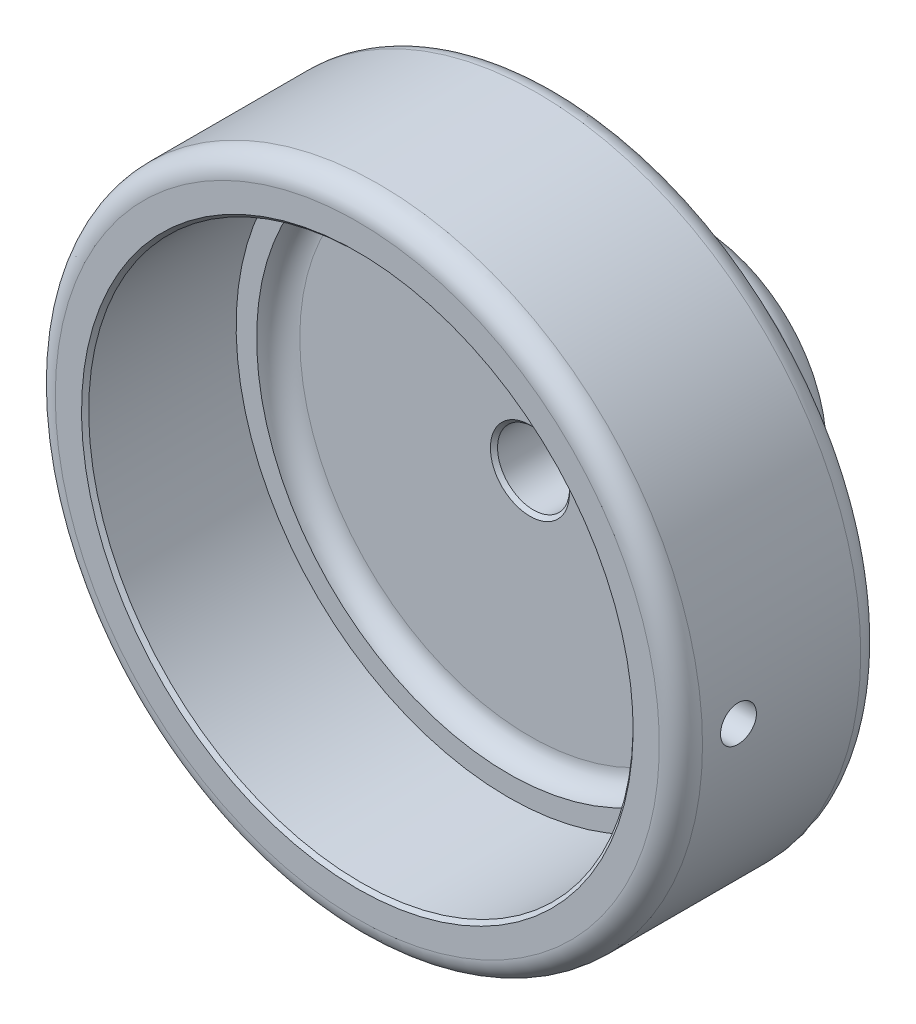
ISO-10303-21;
HEADER;
FILE_DESCRIPTION(('STEP AP214'),'2;1');
FILE_NAME('part.step','',(''),(''),'','','');
FILE_SCHEMA(('AUTOMOTIVE_DESIGN { 1 0 10303 214 1 1 1 1 }'));
ENDSEC;
DATA;
#1=APPLICATION_CONTEXT('core data for automotive mechanical design processes');
#2=APPLICATION_PROTOCOL_DEFINITION('international standard','automotive_design',2000,#1);
#3=PRODUCT_CONTEXT('',#1,'mechanical');
#4=PRODUCT('Part','Part','',(#3));
#5=PRODUCT_RELATED_PRODUCT_CATEGORY('part','',(#4));
#6=PRODUCT_DEFINITION_FORMATION('','',#4);
#7=PRODUCT_DEFINITION_CONTEXT('part definition',#1,'design');
#8=PRODUCT_DEFINITION('design','',#6,#7);
#9=PRODUCT_DEFINITION_SHAPE('','',#8);
#10=(LENGTH_UNIT() NAMED_UNIT(*) SI_UNIT(.MILLI.,.METRE.));
#11=(NAMED_UNIT(*) PLANE_ANGLE_UNIT() SI_UNIT($,.RADIAN.));
#12=(NAMED_UNIT(*) SI_UNIT($,.STERADIAN.) SOLID_ANGLE_UNIT());
#13=UNCERTAINTY_MEASURE_WITH_UNIT(LENGTH_MEASURE(1.E-05),#10,'distance_accuracy_value','');
#14=(GEOMETRIC_REPRESENTATION_CONTEXT(3) GLOBAL_UNCERTAINTY_ASSIGNED_CONTEXT((#13)) GLOBAL_UNIT_ASSIGNED_CONTEXT((#10,
#11,#12)) REPRESENTATION_CONTEXT('',''));
#15=CARTESIAN_POINT('',(0.,0.,0.));
#16=DIRECTION('',(0.,0.,1.));
#17=DIRECTION('',(1.,0.,0.));
#18=AXIS2_PLACEMENT_3D('',#15,#16,#17);
#19=CARTESIAN_POINT('',(0.,0.,71.0801279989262));
#20=DIRECTION('',(0.,0.,1.));
#21=DIRECTION('',(0.,-1.,0.));
#22=AXIS2_PLACEMENT_3D('',#19,#20,#21);
#23=CYLINDRICAL_SURFACE('',#22,37.85);
#24=CARTESIAN_POINT('',(0.,0.,27.));
#25=DIRECTION('',(0.,0.,1.));
#26=DIRECTION('',(1.,0.,0.));
#27=AXIS2_PLACEMENT_3D('',#24,#25,#26);
#28=CIRCLE('',#27,37.85);
#29=CARTESIAN_POINT('',(37.85,0.,27.));
#30=VERTEX_POINT('',#29);
#31=EDGE_CURVE('E320',#30,#30,#28,.T.);
#32=ORIENTED_EDGE('',*,*,#31,.F.);
#33=EDGE_LOOP('',(#32));
#34=FACE_BOUND('',#33,.T.);
#35=CARTESIAN_POINT('',(0.,0.,47.4999999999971));
#36=DIRECTION('',(0.,0.,1.));
#37=DIRECTION('',(0.,-1.,0.));
#38=AXIS2_PLACEMENT_3D('',#35,#36,#37);
#39=CIRCLE('',#38,37.85);
#40=CARTESIAN_POINT('',(0.,-37.85,47.4999999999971));
#41=VERTEX_POINT('',#40);
#42=EDGE_CURVE('E336',#41,#41,#39,.T.);
#43=ORIENTED_EDGE('',*,*,#42,.T.);
#44=EDGE_LOOP('',(#43));
#45=FACE_BOUND('',#44,.T.);
#46=CARTESIAN_POINT('',(37.85,0.,42.4999999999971));
#47=CARTESIAN_POINT('',(37.8499989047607,-0.14026204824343,42.4999938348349));
#48=CARTESIAN_POINT('',(37.8492120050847,-0.280621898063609,42.4881562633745));
#49=CARTESIAN_POINT('',(37.8461485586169,-0.557464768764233,42.4411044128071));
#50=CARTESIAN_POINT('',(37.8438702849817,-0.693943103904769,42.405863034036));
#51=CARTESIAN_POINT('',(37.8380817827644,-0.958972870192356,42.3130212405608));
#52=CARTESIAN_POINT('',(37.8345722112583,-1.08752848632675,42.2554327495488));
#53=CARTESIAN_POINT('',(37.8267156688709,-1.33311529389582,42.1195511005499));
#54=CARTESIAN_POINT('',(37.8223688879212,-1.45014909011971,42.0412626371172));
#55=CARTESIAN_POINT('',(37.8133183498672,-1.66959707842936,41.8660617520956));
#56=CARTESIAN_POINT('',(37.8086140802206,-1.77198964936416,41.7691222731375));
#57=CARTESIAN_POINT('',(37.7993831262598,-1.95906361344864,41.5594271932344));
#58=CARTESIAN_POINT('',(37.7948564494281,-2.04374426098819,41.4466709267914));
#59=CARTESIAN_POINT('',(37.7864871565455,-2.19305863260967,41.2084187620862));
#60=CARTESIAN_POINT('',(37.7826451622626,-2.25767417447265,41.0829114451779));
#61=CARTESIAN_POINT('',(37.7760852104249,-2.36490784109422,40.8227998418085));
#62=CARTESIAN_POINT('',(37.773367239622,-2.40752622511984,40.6881956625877));
#63=CARTESIAN_POINT('',(37.7693667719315,-2.4694952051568,40.4139213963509));
#64=CARTESIAN_POINT('',(37.7680821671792,-2.48887997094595,40.2742590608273));
#65=CARTESIAN_POINT('',(37.7670869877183,-2.5039369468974,39.9936573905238));
#66=CARTESIAN_POINT('',(37.7673763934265,-2.49960945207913,39.8527180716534));
#67=CARTESIAN_POINT('',(37.7694946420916,-2.46739308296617,39.5737962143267));
#68=CARTESIAN_POINT('',(37.7713210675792,-2.43954120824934,39.4358093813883));
#69=CARTESIAN_POINT('',(37.7763037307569,-2.36112409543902,39.1664736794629));
#70=CARTESIAN_POINT('',(37.7794599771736,-2.31055870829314,39.0351248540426));
#71=CARTESIAN_POINT('',(37.7867493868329,-2.1881080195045,38.7826749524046));
#72=CARTESIAN_POINT('',(37.7908833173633,-2.11620596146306,38.6615820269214));
#73=CARTESIAN_POINT('',(37.7996614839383,-1.95313509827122,38.4331704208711));
#74=CARTESIAN_POINT('',(37.8043057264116,-1.86196605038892,38.3258519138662));
#75=CARTESIAN_POINT('',(37.813591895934,-1.66274090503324,38.127820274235));
#76=CARTESIAN_POINT('',(37.8182338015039,-1.55465279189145,38.037139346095));
#77=CARTESIAN_POINT('',(37.8269836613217,-1.3247698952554,37.8752054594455));
#78=CARTESIAN_POINT('',(37.8310916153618,-1.20297510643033,37.8039525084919));
#79=CARTESIAN_POINT('',(37.8383110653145,-0.949116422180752,37.6828998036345));
#80=CARTESIAN_POINT('',(37.8414225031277,-0.817051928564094,37.6331013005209));
#81=CARTESIAN_POINT('',(37.8462975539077,-0.546411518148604,37.5563927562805));
#82=CARTESIAN_POINT('',(37.8480611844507,-0.407835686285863,37.5294824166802));
#83=CARTESIAN_POINT('',(37.8500396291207,-0.128385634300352,37.4993540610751));
#84=CARTESIAN_POINT('',(37.8502573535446,0.0124837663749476,37.4960915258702));
#85=CARTESIAN_POINT('',(37.8491271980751,0.292767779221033,37.5132350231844));
#86=CARTESIAN_POINT('',(37.8477793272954,0.432182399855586,37.5336409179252));
#87=CARTESIAN_POINT('',(37.8436715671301,0.705473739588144,37.5975051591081));
#88=CARTESIAN_POINT('',(37.8409129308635,0.839355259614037,37.6409430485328));
#89=CARTESIAN_POINT('',(37.8342939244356,1.09792825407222,37.7496174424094));
#90=CARTESIAN_POINT('',(37.8304335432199,1.22261963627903,37.8148541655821));
#91=CARTESIAN_POINT('',(37.8220374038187,1.4594765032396,37.9653875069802));
#92=CARTESIAN_POINT('',(37.8175006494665,1.57162307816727,38.0507138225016));
#93=CARTESIAN_POINT('',(37.8082655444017,1.7800164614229,38.2389610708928));
#94=CARTESIAN_POINT('',(37.8035671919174,1.87626309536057,38.3418821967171));
#95=CARTESIAN_POINT('',(37.7945299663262,2.05027560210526,38.5625897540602));
#96=CARTESIAN_POINT('',(37.7901916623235,2.12801256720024,38.680399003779));
#97=CARTESIAN_POINT('',(37.782372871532,2.2626012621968,38.9274241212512));
#98=CARTESIAN_POINT('',(37.7788923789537,2.31945313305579,39.0566399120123));
#99=CARTESIAN_POINT('',(37.7731858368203,2.41060788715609,39.3227050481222));
#100=CARTESIAN_POINT('',(37.7709587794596,2.44492888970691,39.4595481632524));
#101=CARTESIAN_POINT('',(37.7680074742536,2.49010680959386,39.7370698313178));
#102=CARTESIAN_POINT('',(37.7672832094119,2.50096399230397,39.8777483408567));
#103=CARTESIAN_POINT('',(37.7674195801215,2.4989034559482,40.15866005));
#104=CARTESIAN_POINT('',(37.7682771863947,2.4860311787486,40.2988935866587));
#105=CARTESIAN_POINT('',(37.7714742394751,2.43697141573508,40.5752033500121));
#106=CARTESIAN_POINT('',(37.773813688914,2.40078388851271,40.7112795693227));
#107=CARTESIAN_POINT('',(37.7797100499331,2.30613130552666,40.9754181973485));
#108=CARTESIAN_POINT('',(37.783266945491,2.24766654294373,41.1034807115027));
#109=CARTESIAN_POINT('',(37.7911973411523,2.11012507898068,41.3479784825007));
#110=CARTESIAN_POINT('',(37.7955708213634,2.03104887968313,41.4644140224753));
#111=CARTESIAN_POINT('',(37.8046513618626,1.85436046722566,41.6825836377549));
#112=CARTESIAN_POINT('',(37.8093590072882,1.7567152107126,41.7842909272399));
#113=CARTESIAN_POINT('',(37.8185723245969,1.54570851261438,41.9699063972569));
#114=CARTESIAN_POINT('',(37.8230779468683,1.43234323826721,42.0538102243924));
#115=CARTESIAN_POINT('',(37.8313847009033,1.19297226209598,42.2015062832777));
#116=CARTESIAN_POINT('',(37.835184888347,1.06694995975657,42.2652716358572));
#117=CARTESIAN_POINT('',(37.8416402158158,0.806053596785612,42.3706595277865));
#118=CARTESIAN_POINT('',(37.8442966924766,0.671190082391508,42.4123079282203));
#119=CARTESIAN_POINT('',(37.8474712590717,0.446254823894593,42.4614875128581));
#120=CARTESIAN_POINT('',(37.8484153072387,0.357636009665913,42.4759109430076));
#121=CARTESIAN_POINT('',(37.8496800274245,0.179358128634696,42.4951691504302));
#122=CARTESIAN_POINT('',(37.8500007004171,0.0896990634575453,42.5000039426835));
#123=CARTESIAN_POINT('',(37.85,0.,42.4999999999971));
#124=B_SPLINE_CURVE_WITH_KNOTS('',3,(#46,#47,#48,#49,#50,#51,#52,#53,#54,#55,#56,#57,#58,#59,
#60,#61,#62,#63,#64,#65,#66,#67,#68,#69,#70,#71,#72,#73,#74,#75,#76,#77,#78,#79,#80,#81,#82,#83,
#84,#85,#86,#87,#88,#89,#90,#91,#92,#93,#94,#95,#96,#97,#98,#99,#100,#101,#102,#103,#104,#105,
#106,#107,#108,#109,#110,#111,#112,#113,#114,#115,#116,#117,#118,#119,#120,#121,#122,#123),
.UNSPECIFIED.,.T.,.F.,(4,2,2,2,2,2,2,2,2,2,2,2,2,2,2,2,2,2,2,2,2,2,2,2,2,2,2,2,2,2,2,2,2,2,2,2,
2,2,4),(0.,0.420458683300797,0.84140507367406,1.26212716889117,1.6827539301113,2.10399556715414,
2.52525493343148,2.94689492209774,3.36852994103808,3.78954409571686,4.21055301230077,
4.63090098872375,5.05125172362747,5.47193345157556,5.89262047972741,6.31411341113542,
6.73560650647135,7.15712417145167,7.57863633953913,7.99935476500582,8.42007074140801,
8.84041366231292,9.26076080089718,9.68173325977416,10.1027103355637,10.52434062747,
10.9459680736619,11.3672560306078,11.7885392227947,12.2090164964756,12.6294945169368,
13.0499670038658,13.4704292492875,13.8916468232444,14.3129672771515,14.7348477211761,
15.1562337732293,15.4251219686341,15.6940097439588),.UNSPECIFIED.);
#125=CARTESIAN_POINT('',(37.85,0.,42.4999999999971));
#126=VERTEX_POINT('',#125);
#127=EDGE_CURVE('E66',#126,#126,#124,.T.);
#128=ORIENTED_EDGE('',*,*,#127,.T.);
#129=EDGE_LOOP('',(#128));
#130=FACE_BOUND('',#129,.T.);
#131=ADVANCED_FACE('F12',(#34,#45,#130),#23,.F.);
#132=CARTESIAN_POINT('',(0.,0.,20.1026105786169));
#133=DIRECTION('',(0.,0.,-1.));
#134=DIRECTION('',(-1.,0.,0.));
#135=AXIS2_PLACEMENT_3D('',#132,#133,#134);
#136=CYLINDRICAL_SURFACE('',#135,45.);
#137=CARTESIAN_POINT('',(0.,0.,44.9999999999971));
#138=DIRECTION('',(0.,0.,-1.));
#139=DIRECTION('',(-1.,0.,0.));
#140=AXIS2_PLACEMENT_3D('',#137,#138,#139);
#141=CIRCLE('',#140,45.);
#142=CARTESIAN_POINT('',(-45.,0.,44.9999999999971));
#143=VERTEX_POINT('',#142);
#144=EDGE_CURVE('E325',#143,#143,#141,.T.);
#145=ORIENTED_EDGE('',*,*,#144,.T.);
#146=EDGE_LOOP('',(#145));
#147=FACE_BOUND('',#146,.T.);
#148=CARTESIAN_POINT('',(0.,0.,23.));
#149=DIRECTION('',(0.,0.,-1.));
#150=DIRECTION('',(-1.,0.,0.));
#151=AXIS2_PLACEMENT_3D('',#148,#149,#150);
#152=CIRCLE('',#151,45.);
#153=CARTESIAN_POINT('',(-45.,0.,23.));
#154=VERTEX_POINT('',#153);
#155=EDGE_CURVE('E315',#154,#154,#152,.T.);
#156=ORIENTED_EDGE('',*,*,#155,.F.);
#157=EDGE_LOOP('',(#156));
#158=FACE_BOUND('',#157,.T.);
#159=CARTESIAN_POINT('',(45.,0.,42.4999999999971));
#160=CARTESIAN_POINT('',(44.9999990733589,0.140309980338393,42.4999938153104));
#161=CARTESIAN_POINT('',(44.999336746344,0.28071893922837,42.4881481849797));
#162=CARTESIAN_POINT('',(44.9967582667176,0.557661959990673,42.441062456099));
#163=CARTESIAN_POINT('',(44.9948406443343,0.694191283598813,42.4057949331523));
#164=CARTESIAN_POINT('',(44.9899685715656,0.959323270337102,42.3128796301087));
#165=CARTESIAN_POINT('',(44.9870146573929,1.08792999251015,42.2552434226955));
#166=CARTESIAN_POINT('',(44.9804024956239,1.33360894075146,42.1192450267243));
#167=CARTESIAN_POINT('',(44.9767444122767,1.45068384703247,42.0408876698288));
#168=CARTESIAN_POINT('',(44.9691303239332,1.67015225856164,41.8655662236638));
#169=CARTESIAN_POINT('',(44.9651740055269,1.77252998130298,41.7685823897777));
#170=CARTESIAN_POINT('',(44.9574120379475,1.95956316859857,41.5588010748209));
#171=CARTESIAN_POINT('',(44.9536063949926,2.04421790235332,41.4460029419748));
#172=CARTESIAN_POINT('',(44.9465726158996,2.19344818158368,41.2077088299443));
#173=CARTESIAN_POINT('',(44.9433448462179,2.25801100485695,41.0822048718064));
#174=CARTESIAN_POINT('',(44.9378347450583,2.36514325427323,40.8221177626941));
#175=CARTESIAN_POINT('',(44.93555240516,2.40771287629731,40.6875346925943));
#176=CARTESIAN_POINT('',(44.9321934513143,2.46960756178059,40.4132583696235));
#177=CARTESIAN_POINT('',(44.93111558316,2.48895680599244,40.2735705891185));
#178=CARTESIAN_POINT('',(44.9302833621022,2.50393610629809,39.9929258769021));
#179=CARTESIAN_POINT('',(44.93052899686,2.49956638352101,39.8519689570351));
#180=CARTESIAN_POINT('',(44.9323149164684,2.46725189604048,39.5729517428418));
#181=CARTESIAN_POINT('',(44.933853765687,2.43933327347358,39.4348884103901));
#182=CARTESIAN_POINT('',(44.9380504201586,2.36075402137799,39.1654109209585));
#183=CARTESIAN_POINT('',(44.9407082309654,2.31009327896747,39.0339967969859));
#184=CARTESIAN_POINT('',(44.9468449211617,2.18743807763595,38.7814639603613));
#185=CARTESIAN_POINT('',(44.9503242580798,2.11543172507,38.6603510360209));
#186=CARTESIAN_POINT('',(44.9577114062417,1.95213794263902,38.4319218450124));
#187=CARTESIAN_POINT('',(44.9616192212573,1.86085034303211,38.3246056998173));
#188=CARTESIAN_POINT('',(44.9694292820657,1.66143798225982,38.1266642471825));
#189=CARTESIAN_POINT('',(44.9733315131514,1.5532905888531,38.0360617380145));
#190=CARTESIAN_POINT('',(44.9806855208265,1.32330800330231,37.8742951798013));
#191=CARTESIAN_POINT('',(44.9841372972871,1.20147280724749,37.80313113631));
#192=CARTESIAN_POINT('',(44.9902016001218,0.947559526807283,37.6822636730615));
#193=CARTESIAN_POINT('',(44.992814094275,0.815481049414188,37.6325610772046));
#194=CARTESIAN_POINT('',(44.9969049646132,0.544836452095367,37.556042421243));
#195=CARTESIAN_POINT('',(44.9983833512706,0.40627039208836,37.5292261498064));
#196=CARTESIAN_POINT('',(45.0000380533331,0.126781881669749,37.4992695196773));
#197=CARTESIAN_POINT('',(45.0002161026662,-0.0141371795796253,37.4960976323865));
#198=CARTESIAN_POINT('',(44.9992546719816,-0.294505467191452,37.5134374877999));
#199=CARTESIAN_POINT('',(44.9981151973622,-0.433954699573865,37.5339491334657));
#200=CARTESIAN_POINT('',(44.9946481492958,-0.707336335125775,37.5980477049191));
#201=CARTESIAN_POINT('',(44.9923213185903,-0.841272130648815,37.6416202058));
#202=CARTESIAN_POINT('',(44.9867414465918,-1.0999295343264,37.7505889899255));
#203=CARTESIAN_POINT('',(44.9834883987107,-1.22465107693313,37.8159854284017));
#204=CARTESIAN_POINT('',(44.9764175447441,-1.46148419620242,37.9668262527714));
#205=CARTESIAN_POINT('',(44.9725991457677,-1.57358231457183,38.0522917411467));
#206=CARTESIAN_POINT('',(44.9648294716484,-1.7818511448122,38.2408138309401));
#207=CARTESIAN_POINT('',(44.9608781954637,-1.878021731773,38.3438705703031));
#208=CARTESIAN_POINT('',(44.9532831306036,-2.0518119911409,38.5647855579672));
#209=CARTESIAN_POINT('',(44.9496396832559,-2.12941124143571,38.682659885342));
#210=CARTESIAN_POINT('',(44.9430765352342,-2.2637164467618,38.9297829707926));
#211=CARTESIAN_POINT('',(44.9401568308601,-2.32042250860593,39.0590316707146));
#212=CARTESIAN_POINT('',(44.9353728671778,-2.41129615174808,39.3251593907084));
#213=CARTESIAN_POINT('',(44.9335080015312,-2.44547668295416,39.4620339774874));
#214=CARTESIAN_POINT('',(44.9310423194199,-2.49037133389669,39.7395899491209));
#215=CARTESIAN_POINT('',(44.9304414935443,-2.5010856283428,39.8802713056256));
#216=CARTESIAN_POINT('',(44.930571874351,-2.49874201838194,40.1612442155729));
#217=CARTESIAN_POINT('',(44.9313012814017,-2.485716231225,40.301536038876));
#218=CARTESIAN_POINT('',(44.9340061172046,-2.43632868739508,40.5779375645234));
#219=CARTESIAN_POINT('',(44.9359815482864,-2.39996688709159,40.714047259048));
#220=CARTESIAN_POINT('',(44.9409553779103,-2.30494637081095,40.9782267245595));
#221=CARTESIAN_POINT('',(44.9439537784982,-2.24628761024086,41.1062964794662));
#222=CARTESIAN_POINT('',(44.950635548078,-2.10834323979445,41.350772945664));
#223=CARTESIAN_POINT('',(44.9543188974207,-2.02905822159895,41.4671799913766));
#224=CARTESIAN_POINT('',(44.9619611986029,-1.85199494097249,41.6851883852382));
#225=CARTESIAN_POINT('',(44.9659204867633,-1.75419385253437,41.7867711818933));
#226=CARTESIAN_POINT('',(44.9736658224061,-1.54289797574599,41.9721096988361));
#227=CARTESIAN_POINT('',(44.9774518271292,-1.42939934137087,42.0558610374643));
#228=CARTESIAN_POINT('',(44.984427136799,-1.18982445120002,42.2032077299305));
#229=CARTESIAN_POINT('',(44.9876157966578,-1.06373482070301,42.2667813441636));
#230=CARTESIAN_POINT('',(44.9930279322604,-0.802746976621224,42.3717794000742));
#231=CARTESIAN_POINT('',(44.995252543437,-0.66785934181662,42.4132299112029));
#232=CARTESIAN_POINT('',(44.9978997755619,-0.443449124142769,42.4619739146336));
#233=CARTESIAN_POINT('',(44.9986838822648,-0.35537887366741,42.4762153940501));
#234=CARTESIAN_POINT('',(44.9997342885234,-0.178219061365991,42.4952303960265));
#235=CARTESIAN_POINT('',(45.0000005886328,-0.0891295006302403,42.5000039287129));
#236=CARTESIAN_POINT('',(45.,0.,42.4999999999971));
#237=B_SPLINE_CURVE_WITH_KNOTS('',3,(#159,#160,#161,#162,#163,#164,#165,#166,#167,#168,#169,
#170,#171,#172,#173,#174,#175,#176,#177,#178,#179,#180,#181,#182,#183,#184,#185,#186,#187,#188,
#189,#190,#191,#192,#193,#194,#195,#196,#197,#198,#199,#200,#201,#202,#203,#204,#205,#206,#207,
#208,#209,#210,#211,#212,#213,#214,#215,#216,#217,#218,#219,#220,#221,#222,#223,#224,#225,#226,
#227,#228,#229,#230,#231,#232,#233,#234,#235,#236),.UNSPECIFIED.,.T.,.F.,(4,2,2,2,2,2,2,2,2,2,2,
2,2,2,2,2,2,2,2,2,2,2,2,2,2,2,2,2,2,2,2,2,2,2,2,2,2,2,4),(0.,0.420604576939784,
0.841702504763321,1.26258286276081,1.68336516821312,2.10459600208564,2.52584420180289,
2.94735859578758,3.36886923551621,3.78994054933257,4.21100793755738,4.63160850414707,
5.05221115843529,5.47304861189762,5.89388977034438,6.31530080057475,6.73671195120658,
7.15813927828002,7.57956271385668,8.000424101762,8.42128376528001,8.8418804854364,
9.2624801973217,9.68352416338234,10.1045714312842,10.5260796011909,10.9475856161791,
11.3688490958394,11.7901094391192,12.2108002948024,12.6314919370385,13.0521844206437,
13.4728648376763,13.8940672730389,14.3153730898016,14.7371312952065,15.1583914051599,
15.4255735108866,15.6927553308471),.UNSPECIFIED.);
#238=CARTESIAN_POINT('',(45.,0.,42.4999999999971));
#239=VERTEX_POINT('',#238);
#240=EDGE_CURVE('E35',#239,#239,#237,.T.);
#241=ORIENTED_EDGE('',*,*,#240,.T.);
#242=EDGE_LOOP('',(#241));
#243=FACE_BOUND('',#242,.T.);
#244=ADVANCED_FACE('F51',(#147,#158,#243),#136,.T.);
#245=CARTESIAN_POINT('',(0.,0.,72.187489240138));
#246=DIRECTION('',(0.,0.,1.));
#247=DIRECTION('',(1.,0.,0.));
#248=AXIS2_PLACEMENT_3D('',#245,#246,#247);
#249=CYLINDRICAL_SURFACE('',#248,19.);
#250=CARTESIAN_POINT('',(0.,-19.,10.4999999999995));
#251=CARTESIAN_POINT('',(0.139778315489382,-18.999997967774,10.4999941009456));
#252=CARTESIAN_POINT('',(0.279642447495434,-18.9984412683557,10.488237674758));
#253=CARTESIAN_POINT('',(0.555474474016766,-18.9923810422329,10.4415270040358));
#254=CARTESIAN_POINT('',(0.691438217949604,-18.9878744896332,10.406548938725));
#255=CARTESIAN_POINT('',(0.955436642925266,-18.9764219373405,10.3144470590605));
#256=CARTESIAN_POINT('',(1.08347675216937,-18.9694776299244,10.2573386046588));
#257=CARTESIAN_POINT('',(1.32813277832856,-18.9539206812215,10.1226316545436));
#258=CARTESIAN_POINT('',(1.44475055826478,-18.9453083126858,10.0450365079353));
#259=CARTESIAN_POINT('',(1.6639830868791,-18.9273173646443,9.87105538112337));
#260=CARTESIAN_POINT('',(1.76651843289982,-18.9179348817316,9.77456973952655));
#261=CARTESIAN_POINT('',(1.95399133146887,-18.8994924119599,9.56576064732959));
#262=CARTESIAN_POINT('',(2.03892796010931,-18.890432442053,9.45343636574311));
#263=CARTESIAN_POINT('',(2.18909162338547,-18.8736225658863,9.21561789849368));
#264=CARTESIAN_POINT('',(2.25424363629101,-18.8658776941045,9.09007595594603));
#265=CARTESIAN_POINT('',(2.36250946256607,-18.8526269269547,8.82971330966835));
#266=CARTESIAN_POINT('',(2.4056242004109,-18.8471209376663,8.69489299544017));
#267=CARTESIAN_POINT('',(2.46834893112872,-18.8390089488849,8.42062777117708));
#268=CARTESIAN_POINT('',(2.48809350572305,-18.8363863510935,8.281214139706));
#269=CARTESIAN_POINT('',(2.50393399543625,-18.8342874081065,8.00102942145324));
#270=CARTESIAN_POINT('',(2.50003096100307,-18.8348109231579,7.86025839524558));
#271=CARTESIAN_POINT('',(2.46879737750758,-18.8389298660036,7.58229590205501));
#272=CARTESIAN_POINT('',(2.44161547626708,-18.8425058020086,7.44508740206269));
#273=CARTESIAN_POINT('',(2.3648278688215,-18.852296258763,7.17719623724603));
#274=CARTESIAN_POINT('',(2.31522166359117,-18.8585108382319,7.04651371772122));
#275=CARTESIAN_POINT('',(2.19483509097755,-18.8729003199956,6.79492466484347));
#276=CARTESIAN_POINT('',(2.12399053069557,-18.8810811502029,6.67404920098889));
#277=CARTESIAN_POINT('',(1.96318413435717,-18.8984768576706,6.44584606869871));
#278=CARTESIAN_POINT('',(1.87322133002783,-18.9076917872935,6.33851908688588));
#279=CARTESIAN_POINT('',(1.67591027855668,-18.9262039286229,6.13959704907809));
#280=CARTESIAN_POINT('',(1.56843398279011,-18.9355012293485,6.04812896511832));
#281=CARTESIAN_POINT('',(1.33958658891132,-18.9530645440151,5.88451115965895));
#282=CARTESIAN_POINT('',(1.21821545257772,-18.9613305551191,5.8123614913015));
#283=CARTESIAN_POINT('',(0.964922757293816,-18.9759058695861,5.68942691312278));
#284=CARTESIAN_POINT('',(0.832997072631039,-18.9822144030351,5.63865040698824));
#285=CARTESIAN_POINT('',(0.562390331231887,-18.9921571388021,5.56000665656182));
#286=CARTESIAN_POINT('',(0.423709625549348,-18.9957914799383,5.5321382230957));
#287=CARTESIAN_POINT('',(0.144626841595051,-18.9999582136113,5.50026731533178));
#288=CARTESIAN_POINT('',(0.00424505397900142,-19.0005133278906,5.49609001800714));
#289=CARTESIAN_POINT('',(-0.275216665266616,-18.9985205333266,5.5112579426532));
#290=CARTESIAN_POINT('',(-0.414296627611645,-18.9959726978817,5.5306026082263));
#291=CARTESIAN_POINT('',(-0.68668750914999,-18.9880744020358,5.59212005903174));
#292=CARTESIAN_POINT('',(-0.820017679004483,-18.9827342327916,5.63420903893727));
#293=CARTESIAN_POINT('',(-1.07772769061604,-18.9698488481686,5.73993293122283));
#294=CARTESIAN_POINT('',(-1.20210719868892,-18.9623035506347,5.80356864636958));
#295=CARTESIAN_POINT('',(-1.43916303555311,-18.9457917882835,5.95099943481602));
#296=CARTESIAN_POINT('',(-1.55176881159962,-18.9368174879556,6.03490705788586));
#297=CARTESIAN_POINT('',(-1.76136182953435,-18.9184749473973,6.22034123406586));
#298=CARTESIAN_POINT('',(-1.85834838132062,-18.9091066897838,6.32186856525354));
#299=CARTESIAN_POINT('',(-2.03457405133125,-18.8909615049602,6.54043232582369));
#300=CARTESIAN_POINT('',(-2.11369695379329,-18.882188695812,6.65756285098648));
#301=CARTESIAN_POINT('',(-2.25114524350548,-18.8662967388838,6.9035536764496));
#302=CARTESIAN_POINT('',(-2.30947108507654,-18.8591775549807,7.03241372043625));
#303=CARTESIAN_POINT('',(-2.40348340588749,-18.8474274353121,7.29783775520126));
#304=CARTESIAN_POINT('',(-2.43923433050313,-18.8427894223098,7.43437859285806));
#305=CARTESIAN_POINT('',(-2.48728896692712,-18.8365068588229,7.71159084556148));
#306=CARTESIAN_POINT('',(-2.49959389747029,-18.834862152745,7.85226204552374));
#307=CARTESIAN_POINT('',(-2.50038325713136,-18.8347572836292,8.13258521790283));
#308=CARTESIAN_POINT('',(-2.48905029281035,-18.8362727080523,8.27223670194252));
#309=CARTESIAN_POINT('',(-2.44327339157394,-18.8422647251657,8.54763101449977));
#310=CARTESIAN_POINT('',(-2.40882946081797,-18.8467413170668,8.68337384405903));
#311=CARTESIAN_POINT('',(-2.31786734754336,-18.8581434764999,8.94706698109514));
#312=CARTESIAN_POINT('',(-2.26135895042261,-18.8650679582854,9.0750207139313));
#313=CARTESIAN_POINT('',(-2.12788991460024,-18.8805873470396,9.3196597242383));
#314=CARTESIAN_POINT('',(-2.05092891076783,-18.8891822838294,9.4363448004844));
#315=CARTESIAN_POINT('',(-1.87806508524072,-18.9071536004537,9.65606643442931));
#316=CARTESIAN_POINT('',(-1.78202633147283,-18.916535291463,9.75899562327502));
#317=CARTESIAN_POINT('',(-1.57401834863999,-18.9349767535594,9.94734544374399));
#318=CARTESIAN_POINT('',(-1.46204538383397,-18.9440364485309,10.0327619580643));
#319=CARTESIAN_POINT('',(-1.2248027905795,-18.9608556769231,10.1839722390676));
#320=CARTESIAN_POINT('',(-1.09947920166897,-18.9686095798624,10.2496819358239));
#321=CARTESIAN_POINT('',(-0.839540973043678,-18.9818871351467,10.3590273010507));
#322=CARTESIAN_POINT('',(-0.704936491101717,-18.9874131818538,10.4026866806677));
#323=CARTESIAN_POINT('',(-0.474714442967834,-18.9942975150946,10.4563745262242));
#324=CARTESIAN_POINT('',(-0.380541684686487,-18.9964253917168,10.472710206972));
#325=CARTESIAN_POINT('',(-0.19092595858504,-18.9992773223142,10.4945249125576));
#326=CARTESIAN_POINT('',(-0.0954830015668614,-19.0000013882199,10.5000040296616));
#327=CARTESIAN_POINT('',(0.,-19.,10.4999999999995));
#328=B_SPLINE_CURVE_WITH_KNOTS('',3,(#250,#251,#252,#253,#254,#255,#256,#257,#258,#259,#260,
#261,#262,#263,#264,#265,#266,#267,#268,#269,#270,#271,#272,#273,#274,#275,#276,#277,#278,#279,
#280,#281,#282,#283,#284,#285,#286,#287,#288,#289,#290,#291,#292,#293,#294,#295,#296,#297,#298,
#299,#300,#301,#302,#303,#304,#305,#306,#307,#308,#309,#310,#311,#312,#313,#314,#315,#316,#317,
#318,#319,#320,#321,#322,#323,#324,#325,#326,#327),.UNSPECIFIED.,.T.,.F.,(4,2,2,2,2,2,2,2,2,2,2,
2,2,2,2,2,2,2,2,2,2,2,2,2,2,2,2,2,2,2,2,2,2,2,2,2,2,2,4),(0.,0.418986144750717,
0.838402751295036,1.25752877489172,1.67658632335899,2.09791737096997,2.5192705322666,
2.94220203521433,3.36511579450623,3.78558208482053,4.20602969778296,4.62381238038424,
5.04160436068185,5.46067207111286,5.87976101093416,6.30206422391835,6.72436859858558,
7.14683886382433,7.56928719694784,7.9886140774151,8.4079310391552,8.82571338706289,
9.24351130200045,9.66368440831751,10.0838760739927,10.5067272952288,10.9295692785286,
11.3511986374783,11.7728060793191,12.1911686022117,12.6095310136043,13.027708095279,
13.4458926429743,13.8671712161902,14.2885487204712,14.7116990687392,15.1343934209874,
15.4206065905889,15.7068173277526),.UNSPECIFIED.);
#329=CARTESIAN_POINT('',(0.,-19.,10.4999999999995));
#330=VERTEX_POINT('',#329);
#331=EDGE_CURVE('E75',#330,#330,#328,.T.);
#332=ORIENTED_EDGE('',*,*,#331,.T.);
#333=EDGE_LOOP('',(#332));
#334=FACE_BOUND('',#333,.T.);
#335=CARTESIAN_POINT('',(0.,0.,17.));
#336=DIRECTION('',(0.,0.,1.));
#337=DIRECTION('',(1.,0.,0.));
#338=AXIS2_PLACEMENT_3D('',#335,#336,#337);
#339=CIRCLE('',#338,19.);
#340=CARTESIAN_POINT('',(19.,0.,17.));
#341=VERTEX_POINT('',#340);
#342=EDGE_CURVE('E169',#341,#341,#339,.T.);
#343=ORIENTED_EDGE('',*,*,#342,.F.);
#344=EDGE_LOOP('',(#343));
#345=FACE_BOUND('',#344,.T.);
#346=CARTESIAN_POINT('',(0.,0.,2.99999999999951));
#347=DIRECTION('',(0.,0.,1.));
#348=DIRECTION('',(1.,0.,0.));
#349=AXIS2_PLACEMENT_3D('',#346,#347,#348);
#350=CIRCLE('',#349,19.);
#351=CARTESIAN_POINT('',(19.,0.,2.99999999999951));
#352=VERTEX_POINT('',#351);
#353=EDGE_CURVE('E173',#352,#352,#350,.T.);
#354=ORIENTED_EDGE('',*,*,#353,.T.);
#355=EDGE_LOOP('',(#354));
#356=FACE_BOUND('',#355,.T.);
#357=CARTESIAN_POINT('',(19.,0.,5.49999999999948));
#358=CARTESIAN_POINT('',(18.999997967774,0.139778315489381,5.5000058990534));
#359=CARTESIAN_POINT('',(18.9984412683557,0.279642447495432,5.51176232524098));
#360=CARTESIAN_POINT('',(18.9923810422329,0.555474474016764,5.55847299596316));
#361=CARTESIAN_POINT('',(18.9878744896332,0.691438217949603,5.59345106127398));
#362=CARTESIAN_POINT('',(18.9764219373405,0.955436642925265,5.68555294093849));
#363=CARTESIAN_POINT('',(18.9694776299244,1.08347675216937,5.74266139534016));
#364=CARTESIAN_POINT('',(18.9539206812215,1.32813277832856,5.87736834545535));
#365=CARTESIAN_POINT('',(18.9453083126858,1.44475055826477,5.95496349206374));
#366=CARTESIAN_POINT('',(18.9273173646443,1.66398308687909,6.12894461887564));
#367=CARTESIAN_POINT('',(18.9179348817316,1.76651843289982,6.22543026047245));
#368=CARTESIAN_POINT('',(18.8994924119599,1.95399133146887,6.43423935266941));
#369=CARTESIAN_POINT('',(18.890432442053,2.03892796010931,6.5465636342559));
#370=CARTESIAN_POINT('',(18.8736225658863,2.18909162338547,6.78438210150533));
#371=CARTESIAN_POINT('',(18.8658776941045,2.25424363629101,6.90992404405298));
#372=CARTESIAN_POINT('',(18.8526269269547,2.36250946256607,7.17028669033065));
#373=CARTESIAN_POINT('',(18.8471209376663,2.4056242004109,7.30510700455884));
#374=CARTESIAN_POINT('',(18.8390089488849,2.46834893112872,7.57937222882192));
#375=CARTESIAN_POINT('',(18.8363863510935,2.48809350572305,7.718785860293));
#376=CARTESIAN_POINT('',(18.8342874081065,2.50393399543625,7.99897057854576));
#377=CARTESIAN_POINT('',(18.8348109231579,2.50003096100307,8.13974160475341));
#378=CARTESIAN_POINT('',(18.8389298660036,2.46879737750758,8.41770409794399));
#379=CARTESIAN_POINT('',(18.8425058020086,2.44161547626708,8.55491259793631));
#380=CARTESIAN_POINT('',(18.852296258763,2.3648278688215,8.82280376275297));
#381=CARTESIAN_POINT('',(18.8585108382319,2.31522166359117,8.95348628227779));
#382=CARTESIAN_POINT('',(18.8729003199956,2.19483509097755,9.20507533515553));
#383=CARTESIAN_POINT('',(18.8810811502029,2.12399053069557,9.32595079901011));
#384=CARTESIAN_POINT('',(18.8984768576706,1.96318413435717,9.55415393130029));
#385=CARTESIAN_POINT('',(18.9076917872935,1.87322133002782,9.66148091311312));
#386=CARTESIAN_POINT('',(18.9262039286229,1.67591027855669,9.8604029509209));
#387=CARTESIAN_POINT('',(18.9355012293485,1.56843398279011,9.95187103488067));
#388=CARTESIAN_POINT('',(18.9530645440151,1.33958658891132,10.11548884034));
#389=CARTESIAN_POINT('',(18.9613305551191,1.21821545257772,10.1876385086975));
#390=CARTESIAN_POINT('',(18.9759058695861,0.964922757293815,10.3105730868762));
#391=CARTESIAN_POINT('',(18.9822144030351,0.832997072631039,10.3613495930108));
#392=CARTESIAN_POINT('',(18.9921571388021,0.562390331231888,10.4399933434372));
#393=CARTESIAN_POINT('',(18.9957914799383,0.423709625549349,10.4678617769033));
#394=CARTESIAN_POINT('',(18.9999582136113,0.144626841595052,10.4997326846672));
#395=CARTESIAN_POINT('',(19.0005133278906,0.00424505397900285,10.5039099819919));
#396=CARTESIAN_POINT('',(18.9985205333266,-0.275216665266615,10.4887420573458));
#397=CARTESIAN_POINT('',(18.9959726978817,-0.414296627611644,10.4693973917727));
#398=CARTESIAN_POINT('',(18.9880744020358,-0.686687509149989,10.4078799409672));
#399=CARTESIAN_POINT('',(18.9827342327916,-0.820017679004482,10.3657909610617));
#400=CARTESIAN_POINT('',(18.9698488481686,-1.07772769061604,10.2600670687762));
#401=CARTESIAN_POINT('',(18.9623035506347,-1.20210719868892,10.1964313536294));
#402=CARTESIAN_POINT('',(18.9457917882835,-1.43916303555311,10.049000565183));
#403=CARTESIAN_POINT('',(18.9368174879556,-1.55176881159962,9.96509294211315));
#404=CARTESIAN_POINT('',(18.9184749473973,-1.76136182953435,9.77965876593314));
#405=CARTESIAN_POINT('',(18.9091066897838,-1.85834838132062,9.67813143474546));
#406=CARTESIAN_POINT('',(18.8909615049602,-2.03457405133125,9.45956767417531));
#407=CARTESIAN_POINT('',(18.882188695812,-2.11369695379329,9.34243714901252));
#408=CARTESIAN_POINT('',(18.8662967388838,-2.25114524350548,9.0964463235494));
#409=CARTESIAN_POINT('',(18.8591775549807,-2.30947108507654,8.96758627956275));
#410=CARTESIAN_POINT('',(18.8474274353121,-2.40348340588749,8.70216224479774));
#411=CARTESIAN_POINT('',(18.8427894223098,-2.43923433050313,8.56562140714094));
#412=CARTESIAN_POINT('',(18.8365068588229,-2.48728896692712,8.28840915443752));
#413=CARTESIAN_POINT('',(18.834862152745,-2.49959389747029,8.14773795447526));
#414=CARTESIAN_POINT('',(18.8347572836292,-2.50038325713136,7.86741478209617));
#415=CARTESIAN_POINT('',(18.8362727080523,-2.48905029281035,7.72776329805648));
#416=CARTESIAN_POINT('',(18.8422647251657,-2.44327339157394,7.45236898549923));
#417=CARTESIAN_POINT('',(18.8467413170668,-2.40882946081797,7.31662615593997));
#418=CARTESIAN_POINT('',(18.8581434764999,-2.31786734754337,7.05293301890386));
#419=CARTESIAN_POINT('',(18.8650679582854,-2.26135895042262,6.9249792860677));
#420=CARTESIAN_POINT('',(18.8805873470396,-2.12788991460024,6.6803402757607));
#421=CARTESIAN_POINT('',(18.8891822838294,-2.05092891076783,6.5636551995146));
#422=CARTESIAN_POINT('',(18.9071536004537,-1.87806508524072,6.34393356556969));
#423=CARTESIAN_POINT('',(18.916535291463,-1.78202633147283,6.24100437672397));
#424=CARTESIAN_POINT('',(18.9349767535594,-1.57401834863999,6.05265455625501));
#425=CARTESIAN_POINT('',(18.9440364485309,-1.46204538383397,5.96723804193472));
#426=CARTESIAN_POINT('',(18.9608556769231,-1.22480279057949,5.81602776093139));
#427=CARTESIAN_POINT('',(18.9686095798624,-1.09947920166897,5.75031806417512));
#428=CARTESIAN_POINT('',(18.9818871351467,-0.839540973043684,5.64097269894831));
#429=CARTESIAN_POINT('',(18.9874131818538,-0.704936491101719,5.59731331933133));
#430=CARTESIAN_POINT('',(18.9942975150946,-0.474714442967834,5.54362547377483));
#431=CARTESIAN_POINT('',(18.9964253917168,-0.380541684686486,5.52728979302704));
#432=CARTESIAN_POINT('',(18.9992773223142,-0.190925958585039,5.50547508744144));
#433=CARTESIAN_POINT('',(19.0000013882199,-0.0954830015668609,5.49999597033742));
#434=CARTESIAN_POINT('',(19.,0.,5.49999999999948));
#435=B_SPLINE_CURVE_WITH_KNOTS('',3,(#357,#358,#359,#360,#361,#362,#363,#364,#365,#366,#367,
#368,#369,#370,#371,#372,#373,#374,#375,#376,#377,#378,#379,#380,#381,#382,#383,#384,#385,#386,
#387,#388,#389,#390,#391,#392,#393,#394,#395,#396,#397,#398,#399,#400,#401,#402,#403,#404,#405,
#406,#407,#408,#409,#410,#411,#412,#413,#414,#415,#416,#417,#418,#419,#420,#421,#422,#423,#424,
#425,#426,#427,#428,#429,#430,#431,#432,#433,#434),.UNSPECIFIED.,.T.,.F.,(4,2,2,2,2,2,2,2,2,2,2,
2,2,2,2,2,2,2,2,2,2,2,2,2,2,2,2,2,2,2,2,2,2,2,2,2,2,2,4),(0.,0.418986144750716,
0.838402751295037,1.25752877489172,1.67658632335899,2.09791737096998,2.51927053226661,
2.94220203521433,3.36511579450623,3.78558208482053,4.20602969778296,4.62381238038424,
5.04160436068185,5.46067207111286,5.87976101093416,6.30206422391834,6.72436859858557,
7.14683886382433,7.56928719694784,7.98861407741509,8.4079310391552,8.82571338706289,
9.24351130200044,9.6636844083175,10.0838760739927,10.5067272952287,10.9295692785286,
11.3511986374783,11.7728060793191,12.1911686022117,12.6095310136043,13.027708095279,
13.4458926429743,13.8671712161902,14.2885487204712,14.7116990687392,15.1343934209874,
15.4206065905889,15.7068173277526),.UNSPECIFIED.);
#436=CARTESIAN_POINT('',(19.,0.,5.49999999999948));
#437=VERTEX_POINT('',#436);
#438=EDGE_CURVE('E44',#437,#437,#435,.T.);
#439=ORIENTED_EDGE('',*,*,#438,.F.);
#440=EDGE_LOOP('',(#439));
#441=FACE_BOUND('',#440,.T.);
#442=ADVANCED_FACE('F96',(#334,#345,#356,#441),#249,.T.);
#443=CARTESIAN_POINT('',(0.,-38.85,47.9999999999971));
#444=DIRECTION('',(0.,0.,1.));
#445=DIRECTION('',(1.,0.,0.));
#446=AXIS2_PLACEMENT_3D('',#443,#444,#445);
#447=PLANE('',#446);
#448=CARTESIAN_POINT('',(0.,0.,47.9999999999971));
#449=DIRECTION('',(0.,0.,1.));
#450=DIRECTION('',(0.,-1.,0.));
#451=AXIS2_PLACEMENT_3D('',#448,#449,#450);
#452=CIRCLE('',#451,38.35);
#453=CARTESIAN_POINT('',(0.,-38.35,47.9999999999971));
#454=VERTEX_POINT('',#453);
#455=EDGE_CURVE('E43',#454,#454,#452,.F.);
#456=ORIENTED_EDGE('',*,*,#455,.T.);
#457=EDGE_LOOP('',(#456));
#458=FACE_BOUND('',#457,.T.);
#459=CARTESIAN_POINT('',(0.,0.,47.9999999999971));
#460=DIRECTION('',(0.,0.,-1.));
#461=DIRECTION('',(-1.,0.,0.));
#462=AXIS2_PLACEMENT_3D('',#459,#460,#461);
#463=CIRCLE('',#462,42.);
#464=CARTESIAN_POINT('',(-42.,0.,47.9999999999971));
#465=VERTEX_POINT('',#464);
#466=EDGE_CURVE('E74',#465,#465,#463,.T.);
#467=ORIENTED_EDGE('',*,*,#466,.F.);
#468=EDGE_LOOP('',(#467));
#469=FACE_BOUND('',#468,.T.);
#470=ADVANCED_FACE('F100',(#458,#469),#447,.T.);
#471=CARTESIAN_POINT('',(0.,0.,47.4999999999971));
#472=DIRECTION('',(0.,0.,1.));
#473=DIRECTION('',(0.,-1.,0.));
#474=AXIS2_PLACEMENT_3D('',#471,#472,#473);
#475=CONICAL_SURFACE('',#474,37.85,0.785398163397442);
#476=ORIENTED_EDGE('',*,*,#455,.F.);
#477=EDGE_LOOP('',(#476));
#478=FACE_BOUND('',#477,.T.);
#479=ORIENTED_EDGE('',*,*,#42,.F.);
#480=EDGE_LOOP('',(#479));
#481=FACE_BOUND('',#480,.T.);
#482=ADVANCED_FACE('F113',(#478,#481),#475,.F.);
#483=CARTESIAN_POINT('',(0.,0.,24.));
#484=DIRECTION('',(0.,0.,1.));
#485=DIRECTION('',(1.,0.,0.));
#486=AXIS2_PLACEMENT_3D('',#483,#484,#485);
#487=PLANE('',#486);
#488=CARTESIAN_POINT('',(0.,0.,24.));
#489=DIRECTION('',(0.,0.,1.));
#490=DIRECTION('',(1.,0.,0.));
#491=AXIS2_PLACEMENT_3D('',#488,#489,#490);
#492=CIRCLE('',#491,32.);
#493=CARTESIAN_POINT('',(32.,0.,24.));
#494=VERTEX_POINT('',#493);
#495=EDGE_CURVE('E8',#494,#494,#492,.T.);
#496=ORIENTED_EDGE('',*,*,#495,.T.);
#497=EDGE_LOOP('',(#496));
#498=FACE_BOUND('',#497,.T.);
#499=CARTESIAN_POINT('',(0.,0.,24.));
#500=DIRECTION('',(0.,0.,1.));
#501=DIRECTION('',(1.,0.,0.));
#502=AXIS2_PLACEMENT_3D('',#499,#500,#501);
#503=CIRCLE('',#502,5.5);
#504=CARTESIAN_POINT('',(5.5,0.,24.));
#505=VERTEX_POINT('',#504);
#506=EDGE_CURVE('E19',#505,#505,#503,.F.);
#507=ORIENTED_EDGE('',*,*,#506,.T.);
#508=EDGE_LOOP('',(#507));
#509=FACE_BOUND('',#508,.T.);
#510=ADVANCED_FACE('F86',(#498,#509),#487,.T.);
#511=CARTESIAN_POINT('',(0.,0.,27.));
#512=DIRECTION('',(0.,0.,1.));
#513=DIRECTION('',(1.,0.,0.));
#514=AXIS2_PLACEMENT_3D('',#511,#512,#513);
#515=PLANE('',#514);
#516=ORIENTED_EDGE('',*,*,#31,.T.);
#517=EDGE_LOOP('',(#516));
#518=FACE_BOUND('',#517,.T.);
#519=CARTESIAN_POINT('',(0.,0.,27.));
#520=DIRECTION('',(0.,0.,1.));
#521=DIRECTION('',(1.,0.,0.));
#522=AXIS2_PLACEMENT_3D('',#519,#520,#521);
#523=CIRCLE('',#522,35.);
#524=CARTESIAN_POINT('',(35.,0.,27.));
#525=VERTEX_POINT('',#524);
#526=EDGE_CURVE('E323',#525,#525,#523,.F.);
#527=ORIENTED_EDGE('',*,*,#526,.T.);
#528=EDGE_LOOP('',(#527));
#529=FACE_BOUND('',#528,.T.);
#530=ADVANCED_FACE('F282',(#518,#529),#515,.T.);
#531=CARTESIAN_POINT('',(0.,0.,44.9999999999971));
#532=DIRECTION('',(0.,0.,-1.));
#533=DIRECTION('',(-1.,0.,0.));
#534=AXIS2_PLACEMENT_3D('',#531,#532,#533);
#535=TOROIDAL_SURFACE('',#534,42.,3.);
#536=ORIENTED_EDGE('',*,*,#466,.T.);
#537=EDGE_LOOP('',(#536));
#538=FACE_BOUND('',#537,.T.);
#539=ORIENTED_EDGE('',*,*,#144,.F.);
#540=EDGE_LOOP('',(#539));
#541=FACE_BOUND('',#540,.T.);
#542=ADVANCED_FACE('F63',(#538,#541),#535,.T.);
#543=CARTESIAN_POINT('',(0.,0.,23.));
#544=DIRECTION('',(0.,0.,-1.));
#545=DIRECTION('',(-1.,0.,0.));
#546=AXIS2_PLACEMENT_3D('',#543,#544,#545);
#547=TOROIDAL_SURFACE('',#546,42.,3.);
#548=ORIENTED_EDGE('',*,*,#155,.T.);
#549=EDGE_LOOP('',(#548));
#550=FACE_BOUND('',#549,.T.);
#551=CARTESIAN_POINT('',(0.,0.,20.));
#552=DIRECTION('',(0.,0.,-1.));
#553=DIRECTION('',(-1.,0.,0.));
#554=AXIS2_PLACEMENT_3D('',#551,#552,#553);
#555=CIRCLE('',#554,42.);
#556=CARTESIAN_POINT('',(-42.,0.,20.));
#557=VERTEX_POINT('',#556);
#558=EDGE_CURVE('E318',#557,#557,#555,.T.);
#559=ORIENTED_EDGE('',*,*,#558,.F.);
#560=EDGE_LOOP('',(#559));
#561=FACE_BOUND('',#560,.T.);
#562=ADVANCED_FACE('F109',(#550,#561),#547,.T.);
#563=CARTESIAN_POINT('',(0.,-21.,20.));
#564=DIRECTION('',(0.,0.,1.));
#565=DIRECTION('',(1.,0.,0.));
#566=AXIS2_PLACEMENT_3D('',#563,#564,#565);
#567=PLANE('',#566);
#568=CARTESIAN_POINT('',(0.,0.,20.));
#569=DIRECTION('',(0.,0.,1.));
#570=DIRECTION('',(1.,0.,0.));
#571=AXIS2_PLACEMENT_3D('',#568,#569,#570);
#572=CIRCLE('',#571,21.);
#573=CARTESIAN_POINT('',(21.,0.,20.));
#574=VERTEX_POINT('',#573);
#575=EDGE_CURVE('E333',#574,#574,#572,.T.);
#576=ORIENTED_EDGE('',*,*,#575,.T.);
#577=EDGE_LOOP('',(#576));
#578=FACE_BOUND('',#577,.T.);
#579=ORIENTED_EDGE('',*,*,#558,.T.);
#580=EDGE_LOOP('',(#579));
#581=FACE_BOUND('',#580,.T.);
#582=ADVANCED_FACE('F105',(#578,#581),#567,.F.);
#583=CARTESIAN_POINT('',(0.,0.,17.1698756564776));
#584=DIRECTION('',(0.,0.,1.));
#585=DIRECTION('',(1.,0.,0.));
#586=AXIS2_PLACEMENT_3D('',#583,#584,#585);
#587=TOROIDAL_SURFACE('',#586,21.9951865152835,3.);
#588=ORIENTED_EDGE('',*,*,#575,.F.);
#589=EDGE_LOOP('',(#588));
#590=FACE_BOUND('',#589,.T.);
#591=ORIENTED_EDGE('',*,*,#342,.T.);
#592=EDGE_LOOP('',(#591));
#593=FACE_BOUND('',#592,.T.);
#594=ADVANCED_FACE('F94',(#590,#593),#587,.F.);
#595=CARTESIAN_POINT('',(0.,0.,2.99999999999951));
#596=DIRECTION('',(0.,0.,1.));
#597=DIRECTION('',(1.,0.,0.));
#598=AXIS2_PLACEMENT_3D('',#595,#596,#597);
#599=TOROIDAL_SURFACE('',#598,16.,3.);
#600=CARTESIAN_POINT('',(0.,0.,-4.9960036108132E-13));
#601=DIRECTION('',(0.,0.,1.));
#602=DIRECTION('',(1.,0.,0.));
#603=AXIS2_PLACEMENT_3D('',#600,#601,#602);
#604=CIRCLE('',#603,16.);
#605=CARTESIAN_POINT('',(16.,0.,-4.9960036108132E-13));
#606=VERTEX_POINT('',#605);
#607=EDGE_CURVE('E328',#606,#606,#604,.T.);
#608=ORIENTED_EDGE('',*,*,#607,.T.);
#609=EDGE_LOOP('',(#608));
#610=FACE_BOUND('',#609,.T.);
#611=ORIENTED_EDGE('',*,*,#353,.F.);
#612=EDGE_LOOP('',(#611));
#613=FACE_BOUND('',#612,.T.);
#614=ADVANCED_FACE('F91',(#610,#613),#599,.T.);
#615=CARTESIAN_POINT('',(0.,0.,0.));
#616=DIRECTION('',(0.,0.,1.));
#617=DIRECTION('',(1.,0.,0.));
#618=AXIS2_PLACEMENT_3D('',#615,#616,#617);
#619=PLANE('',#618);
#620=CARTESIAN_POINT('',(0.,0.,0.));
#621=DIRECTION('',(0.,0.,1.));
#622=DIRECTION('',(1.,0.,0.));
#623=AXIS2_PLACEMENT_3D('',#620,#621,#622);
#624=CIRCLE('',#623,5.5000000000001);
#625=CARTESIAN_POINT('',(5.5000000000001,0.,0.));
#626=VERTEX_POINT('',#625);
#627=EDGE_CURVE('E23',#626,#626,#624,.T.);
#628=ORIENTED_EDGE('',*,*,#627,.T.);
#629=EDGE_LOOP('',(#628));
#630=FACE_BOUND('',#629,.T.);
#631=ORIENTED_EDGE('',*,*,#607,.F.);
#632=EDGE_LOOP('',(#631));
#633=FACE_BOUND('',#632,.T.);
#634=ADVANCED_FACE('F88',(#630,#633),#619,.F.);
#635=CARTESIAN_POINT('',(45.,0.,7.9999999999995));
#636=DIRECTION('',(-1.,0.,0.));
#637=DIRECTION('',(0.,0.,1.));
#638=AXIS2_PLACEMENT_3D('',#635,#636,#637);
#639=CYLINDRICAL_SURFACE('',#638,2.5);
#640=CARTESIAN_POINT('',(5.,0.,10.4999999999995));
#641=CARTESIAN_POINT('',(4.99999177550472,0.131426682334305,10.4999903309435));
#642=CARTESIAN_POINT('',(4.99476199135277,0.263015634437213,10.4895744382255));
#643=CARTESIAN_POINT('',(4.9743541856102,0.522301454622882,10.4483681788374));
#644=CARTESIAN_POINT('',(4.9591572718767,0.649990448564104,10.4175391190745));
#645=CARTESIAN_POINT('',(4.92040690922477,0.897333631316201,10.3370153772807));
#646=CARTESIAN_POINT('',(4.89688595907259,1.01701694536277,10.2873940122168));
#647=CARTESIAN_POINT('',(4.84364443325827,1.24618160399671,10.1710734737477));
#648=CARTESIAN_POINT('',(4.81392434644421,1.3556637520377,10.1043756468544));
#649=CARTESIAN_POINT('',(4.74890645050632,1.56876952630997,9.95120686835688));
#650=CARTESIAN_POINT('',(4.71337997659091,1.67163802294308,9.86378379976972));
#651=CARTESIAN_POINT('',(4.64149925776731,1.86194861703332,9.67369630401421));
#652=CARTESIAN_POINT('',(4.60514440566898,1.94937895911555,9.5710203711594));
#653=CARTESIAN_POINT('',(4.53247377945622,2.11312999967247,9.34379162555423));
#654=CARTESIAN_POINT('',(4.49637967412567,2.18806333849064,9.2181597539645));
#655=CARTESIAN_POINT('',(4.43214946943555,2.31542056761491,8.95408166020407));
#656=CARTESIAN_POINT('',(4.40400769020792,2.36786053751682,8.81564467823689));
#657=CARTESIAN_POINT('',(4.36144667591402,2.44533110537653,8.53833723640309));
#658=CARTESIAN_POINT('',(4.34630678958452,2.47181464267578,8.39998886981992));
#659=CARTESIAN_POINT('',(4.3295472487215,2.50106748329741,8.12005290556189));
#660=CARTESIAN_POINT('',(4.3279142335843,2.50386022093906,7.97846864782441));
#661=CARTESIAN_POINT('',(4.33777325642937,2.48671821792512,7.71428493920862));
#662=CARTESIAN_POINT('',(4.34771909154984,2.46946139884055,7.59143992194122));
#663=CARTESIAN_POINT('',(4.37690571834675,2.41734962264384,7.35069522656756));
#664=CARTESIAN_POINT('',(4.39614947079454,2.38248905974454,7.23279713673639));
#665=CARTESIAN_POINT('',(4.44218691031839,2.29552445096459,7.00192716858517));
#666=CARTESIAN_POINT('',(4.46914601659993,2.24303766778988,6.88913400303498));
#667=CARTESIAN_POINT('',(4.52758510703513,2.12260421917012,6.67341426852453));
#668=CARTESIAN_POINT('',(4.55906711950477,2.0546506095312,6.57049216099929));
#669=CARTESIAN_POINT('',(4.62782894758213,1.89516513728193,6.36369686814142));
#670=CARTESIAN_POINT('',(4.66533775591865,1.80173614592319,6.2613578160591));
#671=CARTESIAN_POINT('',(4.73869058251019,1.59888894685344,6.07316145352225));
#672=CARTESIAN_POINT('',(4.77453379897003,1.48946314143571,5.9873120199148));
#673=CARTESIAN_POINT('',(4.84254968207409,1.25129126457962,5.83078584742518));
#674=CARTESIAN_POINT('',(4.87447460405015,1.12188397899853,5.76099881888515));
#675=CARTESIAN_POINT('',(4.92894702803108,0.851165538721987,5.64475742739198));
#676=CARTESIAN_POINT('',(4.95150197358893,0.709863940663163,5.5982845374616));
#677=CARTESIAN_POINT('',(4.98310834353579,0.431916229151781,5.53381149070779));
#678=CARTESIAN_POINT('',(4.9931234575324,0.295853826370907,5.5137719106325));
#679=CARTESIAN_POINT('',(5.00182533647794,0.0219489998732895,5.49633817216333));
#680=CARTESIAN_POINT('',(5.00051746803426,-0.115892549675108,5.498933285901));
#681=CARTESIAN_POINT('',(4.98727980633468,-0.378082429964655,5.52551672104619));
#682=CARTESIAN_POINT('',(4.97618114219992,-0.502648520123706,5.5478313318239));
#683=CARTESIAN_POINT('',(4.94555428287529,-0.74601723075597,5.61059517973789));
#684=CARTESIAN_POINT('',(4.92602515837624,-0.86481921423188,5.6510464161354));
#685=CARTESIAN_POINT('',(4.87960628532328,-1.09722152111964,5.74999616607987));
#686=CARTESIAN_POINT('',(4.85252204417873,-1.21057599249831,5.80897762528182));
#687=CARTESIAN_POINT('',(4.79359935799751,-1.42615340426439,5.94276883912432));
#688=CARTESIAN_POINT('',(4.76175888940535,-1.52837157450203,6.01758533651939));
#689=CARTESIAN_POINT('',(4.69270553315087,-1.72941922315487,6.18940106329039));
#690=CARTESIAN_POINT('',(4.65527212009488,-1.82693019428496,6.2878571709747));
#691=CARTESIAN_POINT('',(4.58155978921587,-2.0046408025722,6.49981287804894));
#692=CARTESIAN_POINT('',(4.54528168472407,-2.08482846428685,6.61332279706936));
#693=CARTESIAN_POINT('',(4.4762798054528,-2.22926978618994,6.85910913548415));
#694=CARTESIAN_POINT('',(4.44381323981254,-2.29256373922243,6.99202816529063));
#695=CARTESIAN_POINT('',(4.38935180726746,-2.39520706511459,7.26877516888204));
#696=CARTESIAN_POINT('',(4.36734345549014,-2.43458729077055,7.41258881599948));
#697=CARTESIAN_POINT('',(4.33903752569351,-2.48465421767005,7.69227555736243));
#698=CARTESIAN_POINT('',(4.33143458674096,-2.4977324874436,7.82758563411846));
#699=CARTESIAN_POINT('',(4.32913386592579,-2.50172288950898,8.09861766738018));
#700=CARTESIAN_POINT('',(4.33443049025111,-2.49264462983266,8.23433941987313));
#701=CARTESIAN_POINT('',(4.35594655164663,-2.45481530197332,8.48870875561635));
#702=CARTESIAN_POINT('',(4.37107736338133,-2.42802074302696,8.60775118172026));
#703=CARTESIAN_POINT('',(4.40927540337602,-2.35793843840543,8.83952029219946));
#704=CARTESIAN_POINT('',(4.43234518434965,-2.31464538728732,8.95224493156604));
#705=CARTESIAN_POINT('',(4.48571326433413,-2.20953919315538,9.17656215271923));
#706=CARTESIAN_POINT('',(4.5163930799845,-2.14667719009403,9.28756985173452));
#707=CARTESIAN_POINT('',(4.58088327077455,-2.0053780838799,9.49818624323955));
#708=CARTESIAN_POINT('',(4.61469526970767,-1.92693287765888,9.59778896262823));
#709=CARTESIAN_POINT('',(4.68655816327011,-1.74550556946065,9.79535536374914));
#710=CARTESIAN_POINT('',(4.72462491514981,-1.64070022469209,9.89164936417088));
#711=CARTESIAN_POINT('',(4.79694347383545,-1.41539785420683,10.0656558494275));
#712=CARTESIAN_POINT('',(4.83119321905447,-1.29489242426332,10.1433583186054));
#713=CARTESIAN_POINT('',(4.89245149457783,-1.03978808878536,10.2780969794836));
#714=CARTESIAN_POINT('',(4.91940711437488,-0.905095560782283,10.334983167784));
#715=CARTESIAN_POINT('',(4.95177960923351,-0.696328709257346,10.4021838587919));
#716=CARTESIAN_POINT('',(4.96122314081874,-0.625670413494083,10.4215553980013));
#717=CARTESIAN_POINT('',(4.97717127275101,-0.482623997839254,10.4540659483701));
#718=CARTESIAN_POINT('',(4.98367766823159,-0.410236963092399,10.4672087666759));
#719=CARTESIAN_POINT('',(4.9923820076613,-0.28151868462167,10.4847374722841));
#720=CARTESIAN_POINT('',(4.99523288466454,-0.225408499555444,10.4904549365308));
#721=CARTESIAN_POINT('',(4.99904367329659,-0.112875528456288,10.4980883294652));
#722=CARTESIAN_POINT('',(5.00000353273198,-0.0564527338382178,10.500004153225));
#723=CARTESIAN_POINT('',(5.,0.,10.4999999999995));
#724=B_SPLINE_CURVE_WITH_KNOTS('',3,(#640,#641,#642,#643,#644,#645,#646,#647,#648,#649,#650,
#651,#652,#653,#654,#655,#656,#657,#658,#659,#660,#661,#662,#663,#664,#665,#666,#667,#668,#669,
#670,#671,#672,#673,#674,#675,#676,#677,#678,#679,#680,#681,#682,#683,#684,#685,#686,#687,#688,
#689,#690,#691,#692,#693,#694,#695,#696,#697,#698,#699,#700,#701,#702,#703,#704,#705,#706,#707,
#708,#709,#710,#711,#712,#713,#714,#715,#716,#717,#718,#719,#720,#721,#722,#723),.UNSPECIFIED.,
.T.,.F.,(4,2,2,2,2,2,2,2,2,2,2,2,2,2,2,2,2,2,2,2,2,2,2,2,2,2,2,2,2,2,2,2,2,2,2,2,2,2,2,2,2,4),
(0.,0.394060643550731,0.788870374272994,1.18215538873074,1.57540940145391,1.99245439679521,
2.40981559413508,2.85954316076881,3.30894869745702,3.73145030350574,4.15353393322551,
4.52514281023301,4.89687009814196,5.27725600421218,5.65781303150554,6.08662353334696,
6.51563836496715,6.96457555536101,7.41315542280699,7.82458226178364,8.2358141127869,
8.61517266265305,8.99457304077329,9.38482140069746,9.77523626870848,10.2039902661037,
10.6330397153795,11.0828670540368,11.53211279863,11.9382326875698,12.3441764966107,
12.7114482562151,13.0788382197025,13.4709114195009,13.8631890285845,14.303131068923,
14.7433095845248,15.1866003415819,15.407934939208,15.6291340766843,15.7983933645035,
15.9676573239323),.UNSPECIFIED.);
#725=CARTESIAN_POINT('',(5.,0.,10.4999999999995));
#726=VERTEX_POINT('',#725);
#727=EDGE_CURVE('E140',#726,#726,#724,.T.);
#728=ORIENTED_EDGE('',*,*,#727,.T.);
#729=EDGE_LOOP('',(#728));
#730=FACE_BOUND('',#729,.T.);
#731=ORIENTED_EDGE('',*,*,#438,.T.);
#732=EDGE_LOOP('',(#731));
#733=FACE_BOUND('',#732,.T.);
#734=ADVANCED_FACE('F59',(#730,#733),#639,.F.);
#735=CARTESIAN_POINT('',(45.,0.,39.9999999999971));
#736=DIRECTION('',(-1.,0.,0.));
#737=DIRECTION('',(0.,0.,1.));
#738=AXIS2_PLACEMENT_3D('',#735,#736,#737);
#739=CYLINDRICAL_SURFACE('',#738,2.5);
#740=ORIENTED_EDGE('',*,*,#127,.F.);
#741=EDGE_LOOP('',(#740));
#742=FACE_BOUND('',#741,.T.);
#743=ORIENTED_EDGE('',*,*,#240,.F.);
#744=EDGE_LOOP('',(#743));
#745=FACE_BOUND('',#744,.T.);
#746=ADVANCED_FACE('F55',(#742,#745),#739,.F.);
#747=CARTESIAN_POINT('',(0.,-45.,7.9999999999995));
#748=DIRECTION('',(0.,1.,0.));
#749=DIRECTION('',(0.,0.,1.));
#750=AXIS2_PLACEMENT_3D('',#747,#748,#749);
#751=CYLINDRICAL_SURFACE('',#750,2.5);
#752=CARTESIAN_POINT('',(0.,-5.,10.4999999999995));
#753=CARTESIAN_POINT('',(-0.131426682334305,-4.99999177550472,10.4999903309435));
#754=CARTESIAN_POINT('',(-0.263015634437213,-4.99476199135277,10.4895744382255));
#755=CARTESIAN_POINT('',(-0.522301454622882,-4.9743541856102,10.4483681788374));
#756=CARTESIAN_POINT('',(-0.649990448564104,-4.9591572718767,10.4175391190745));
#757=CARTESIAN_POINT('',(-0.897333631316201,-4.92040690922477,10.3370153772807));
#758=CARTESIAN_POINT('',(-1.01701694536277,-4.89688595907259,10.2873940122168));
#759=CARTESIAN_POINT('',(-1.24618160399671,-4.84364443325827,10.1710734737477));
#760=CARTESIAN_POINT('',(-1.3556637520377,-4.81392434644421,10.1043756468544));
#761=CARTESIAN_POINT('',(-1.56876952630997,-4.74890645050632,9.95120686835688));
#762=CARTESIAN_POINT('',(-1.67163802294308,-4.71337997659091,9.86378379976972));
#763=CARTESIAN_POINT('',(-1.86194861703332,-4.64149925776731,9.67369630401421));
#764=CARTESIAN_POINT('',(-1.94937895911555,-4.60514440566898,9.5710203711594));
#765=CARTESIAN_POINT('',(-2.11312999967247,-4.53247377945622,9.34379162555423));
#766=CARTESIAN_POINT('',(-2.18806333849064,-4.49637967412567,9.2181597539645));
#767=CARTESIAN_POINT('',(-2.31542056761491,-4.43214946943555,8.95408166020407));
#768=CARTESIAN_POINT('',(-2.36786053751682,-4.40400769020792,8.81564467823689));
#769=CARTESIAN_POINT('',(-2.44533110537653,-4.36144667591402,8.53833723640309));
#770=CARTESIAN_POINT('',(-2.47181464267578,-4.34630678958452,8.39998886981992));
#771=CARTESIAN_POINT('',(-2.50106748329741,-4.3295472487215,8.1200529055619));
#772=CARTESIAN_POINT('',(-2.50386022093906,-4.3279142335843,7.97846864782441));
#773=CARTESIAN_POINT('',(-2.48671821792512,-4.33777325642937,7.71428493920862));
#774=CARTESIAN_POINT('',(-2.46946139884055,-4.34771909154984,7.59143992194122));
#775=CARTESIAN_POINT('',(-2.41734962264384,-4.37690571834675,7.35069522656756));
#776=CARTESIAN_POINT('',(-2.38248905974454,-4.39614947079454,7.23279713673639));
#777=CARTESIAN_POINT('',(-2.2955244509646,-4.44218691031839,7.00192716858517));
#778=CARTESIAN_POINT('',(-2.24303766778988,-4.46914601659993,6.88913400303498));
#779=CARTESIAN_POINT('',(-2.12260421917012,-4.52758510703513,6.67341426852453));
#780=CARTESIAN_POINT('',(-2.0546506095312,-4.55906711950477,6.57049216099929));
#781=CARTESIAN_POINT('',(-1.89516513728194,-4.62782894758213,6.36369686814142));
#782=CARTESIAN_POINT('',(-1.80173614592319,-4.66533775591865,6.2613578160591));
#783=CARTESIAN_POINT('',(-1.59888894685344,-4.73869058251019,6.07316145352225));
#784=CARTESIAN_POINT('',(-1.48946314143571,-4.77453379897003,5.98731201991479));
#785=CARTESIAN_POINT('',(-1.25129126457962,-4.84254968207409,5.83078584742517));
#786=CARTESIAN_POINT('',(-1.12188397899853,-4.87447460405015,5.76099881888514));
#787=CARTESIAN_POINT('',(-0.851165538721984,-4.92894702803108,5.64475742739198));
#788=CARTESIAN_POINT('',(-0.709863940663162,-4.95150197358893,5.5982845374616));
#789=CARTESIAN_POINT('',(-0.431916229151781,-4.98310834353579,5.53381149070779));
#790=CARTESIAN_POINT('',(-0.295853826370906,-4.9931234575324,5.5137719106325));
#791=CARTESIAN_POINT('',(-0.0219489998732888,-5.00182533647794,5.49633817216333));
#792=CARTESIAN_POINT('',(0.115892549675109,-5.00051746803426,5.498933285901));
#793=CARTESIAN_POINT('',(0.378082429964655,-4.98727980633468,5.52551672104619));
#794=CARTESIAN_POINT('',(0.502648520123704,-4.97618114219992,5.5478313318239));
#795=CARTESIAN_POINT('',(0.746017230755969,-4.94555428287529,5.61059517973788));
#796=CARTESIAN_POINT('',(0.864819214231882,-4.92602515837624,5.65104641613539));
#797=CARTESIAN_POINT('',(1.09722152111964,-4.87960628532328,5.74999616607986));
#798=CARTESIAN_POINT('',(1.2105759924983,-4.85252204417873,5.80897762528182));
#799=CARTESIAN_POINT('',(1.42615340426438,-4.79359935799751,5.94276883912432));
#800=CARTESIAN_POINT('',(1.52837157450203,-4.76175888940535,6.01758533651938));
#801=CARTESIAN_POINT('',(1.72941922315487,-4.69270553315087,6.18940106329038));
#802=CARTESIAN_POINT('',(1.82693019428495,-4.65527212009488,6.2878571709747));
#803=CARTESIAN_POINT('',(2.0046408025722,-4.58155978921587,6.49981287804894));
#804=CARTESIAN_POINT('',(2.08482846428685,-4.54528168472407,6.61332279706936));
#805=CARTESIAN_POINT('',(2.22926978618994,-4.4762798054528,6.85910913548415));
#806=CARTESIAN_POINT('',(2.29256373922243,-4.44381323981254,6.99202816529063));
#807=CARTESIAN_POINT('',(2.39520706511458,-4.38935180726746,7.26877516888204));
#808=CARTESIAN_POINT('',(2.43458729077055,-4.36734345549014,7.41258881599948));
#809=CARTESIAN_POINT('',(2.48465421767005,-4.33903752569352,7.69227555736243));
#810=CARTESIAN_POINT('',(2.4977324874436,-4.33143458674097,7.82758563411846));
#811=CARTESIAN_POINT('',(2.50172288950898,-4.32913386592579,8.09861766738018));
#812=CARTESIAN_POINT('',(2.49264462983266,-4.3344304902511,8.23433941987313));
#813=CARTESIAN_POINT('',(2.45481530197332,-4.35594655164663,8.48870875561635));
#814=CARTESIAN_POINT('',(2.42802074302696,-4.37107736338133,8.60775118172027));
#815=CARTESIAN_POINT('',(2.35793843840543,-4.40927540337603,8.83952029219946));
#816=CARTESIAN_POINT('',(2.31464538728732,-4.43234518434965,8.95224493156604));
#817=CARTESIAN_POINT('',(2.20953919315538,-4.48571326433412,9.17656215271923));
#818=CARTESIAN_POINT('',(2.14667719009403,-4.5163930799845,9.28756985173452));
#819=CARTESIAN_POINT('',(2.0053780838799,-4.58088327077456,9.49818624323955));
#820=CARTESIAN_POINT('',(1.92693287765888,-4.61469526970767,9.59778896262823));
#821=CARTESIAN_POINT('',(1.74550556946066,-4.68655816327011,9.79535536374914));
#822=CARTESIAN_POINT('',(1.64070022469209,-4.7246249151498,9.89164936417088));
#823=CARTESIAN_POINT('',(1.41539785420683,-4.79694347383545,10.0656558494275));
#824=CARTESIAN_POINT('',(1.29489242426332,-4.83119321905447,10.1433583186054));
#825=CARTESIAN_POINT('',(1.03978808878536,-4.89245149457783,10.2780969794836));
#826=CARTESIAN_POINT('',(0.905095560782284,-4.91940711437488,10.334983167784));
#827=CARTESIAN_POINT('',(0.696328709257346,-4.95177960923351,10.4021838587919));
#828=CARTESIAN_POINT('',(0.625670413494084,-4.96122314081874,10.4215553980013));
#829=CARTESIAN_POINT('',(0.482623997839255,-4.97717127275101,10.4540659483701));
#830=CARTESIAN_POINT('',(0.410236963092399,-4.98367766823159,10.4672087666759));
#831=CARTESIAN_POINT('',(0.28151868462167,-4.9923820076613,10.4847374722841));
#832=CARTESIAN_POINT('',(0.225408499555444,-4.99523288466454,10.4904549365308));
#833=CARTESIAN_POINT('',(0.112875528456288,-4.99904367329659,10.4980883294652));
#834=CARTESIAN_POINT('',(0.0564527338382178,-5.00000353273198,10.500004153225));
#835=CARTESIAN_POINT('',(0.,-5.,10.4999999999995));
#836=B_SPLINE_CURVE_WITH_KNOTS('',3,(#752,#753,#754,#755,#756,#757,#758,#759,#760,#761,#762,
#763,#764,#765,#766,#767,#768,#769,#770,#771,#772,#773,#774,#775,#776,#777,#778,#779,#780,#781,
#782,#783,#784,#785,#786,#787,#788,#789,#790,#791,#792,#793,#794,#795,#796,#797,#798,#799,#800,
#801,#802,#803,#804,#805,#806,#807,#808,#809,#810,#811,#812,#813,#814,#815,#816,#817,#818,#819,
#820,#821,#822,#823,#824,#825,#826,#827,#828,#829,#830,#831,#832,#833,#834,#835),.UNSPECIFIED.,
.T.,.F.,(4,2,2,2,2,2,2,2,2,2,2,2,2,2,2,2,2,2,2,2,2,2,2,2,2,2,2,2,2,2,2,2,2,2,2,2,2,2,2,2,2,4),
(0.,0.394060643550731,0.788870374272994,1.18215538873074,1.57540940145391,1.99245439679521,
2.40981559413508,2.85954316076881,3.30894869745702,3.73145030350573,4.15353393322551,
4.52514281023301,4.89687009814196,5.27725600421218,5.65781303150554,6.08662353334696,
6.51563836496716,6.96457555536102,7.41315542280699,7.82458226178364,8.2358141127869,
8.61517266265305,8.99457304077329,9.38482140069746,9.77523626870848,10.2039902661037,
10.6330397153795,11.0828670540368,11.53211279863,11.9382326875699,12.3441764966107,
12.7114482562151,13.0788382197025,13.4709114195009,13.8631890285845,14.303131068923,
14.7433095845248,15.1866003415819,15.407934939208,15.6291340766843,15.7983933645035,
15.9676573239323),.UNSPECIFIED.);
#837=CARTESIAN_POINT('',(0.,-5.,10.4999999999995));
#838=VERTEX_POINT('',#837);
#839=EDGE_CURVE('E143',#838,#838,#836,.T.);
#840=ORIENTED_EDGE('',*,*,#839,.F.);
#841=EDGE_LOOP('',(#840));
#842=FACE_BOUND('',#841,.T.);
#843=ORIENTED_EDGE('',*,*,#331,.F.);
#844=EDGE_LOOP('',(#843));
#845=FACE_BOUND('',#844,.T.);
#846=ADVANCED_FACE('F58',(#842,#845),#751,.F.);
#847=CARTESIAN_POINT('',(0.,0.,48.0009999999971));
#848=DIRECTION('',(0.,0.,-1.));
#849=DIRECTION('',(-1.,0.,0.));
#850=AXIS2_PLACEMENT_3D('',#847,#848,#849);
#851=CYLINDRICAL_SURFACE('',#850,5.);
#852=CARTESIAN_POINT('',(0.,0.,0.500000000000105));
#853=DIRECTION('',(0.,0.,1.));
#854=DIRECTION('',(1.,0.,0.));
#855=AXIS2_PLACEMENT_3D('',#852,#853,#854);
#856=CIRCLE('',#855,5.);
#857=CARTESIAN_POINT('',(5.,0.,0.500000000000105));
#858=VERTEX_POINT('',#857);
#859=EDGE_CURVE('E27',#858,#858,#856,.F.);
#860=ORIENTED_EDGE('',*,*,#859,.T.);
#861=EDGE_LOOP('',(#860));
#862=FACE_BOUND('',#861,.T.);
#863=CARTESIAN_POINT('',(0.,0.,23.5));
#864=DIRECTION('',(0.,0.,1.));
#865=DIRECTION('',(1.,0.,0.));
#866=AXIS2_PLACEMENT_3D('',#863,#864,#865);
#867=CIRCLE('',#866,5.);
#868=CARTESIAN_POINT('',(5.,0.,23.5));
#869=VERTEX_POINT('',#868);
#870=EDGE_CURVE('E32',#869,#869,#867,.T.);
#871=ORIENTED_EDGE('',*,*,#870,.T.);
#872=EDGE_LOOP('',(#871));
#873=FACE_BOUND('',#872,.T.);
#874=ORIENTED_EDGE('',*,*,#727,.F.);
#875=EDGE_LOOP('',(#874));
#876=FACE_BOUND('',#875,.T.);
#877=ORIENTED_EDGE('',*,*,#839,.T.);
#878=EDGE_LOOP('',(#877));
#879=FACE_BOUND('',#878,.T.);
#880=ADVANCED_FACE('F121',(#862,#873,#876,#879),#851,.F.);
#881=CARTESIAN_POINT('',(0.,0.,0.500000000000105));
#882=DIRECTION('',(0.,0.,-1.));
#883=DIRECTION('',(-1.,0.,0.));
#884=AXIS2_PLACEMENT_3D('',#881,#882,#883);
#885=CONICAL_SURFACE('',#884,5.,0.785398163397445);
#886=ORIENTED_EDGE('',*,*,#627,.F.);
#887=EDGE_LOOP('',(#886));
#888=FACE_BOUND('',#887,.T.);
#889=ORIENTED_EDGE('',*,*,#859,.F.);
#890=EDGE_LOOP('',(#889));
#891=FACE_BOUND('',#890,.T.);
#892=ADVANCED_FACE('F118',(#888,#891),#885,.F.);
#893=CARTESIAN_POINT('',(0.,0.,24.));
#894=DIRECTION('',(0.,0.,1.));
#895=DIRECTION('',(1.,0.,0.));
#896=AXIS2_PLACEMENT_3D('',#893,#894,#895);
#897=CONICAL_SURFACE('',#896,5.5,0.785398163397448);
#898=ORIENTED_EDGE('',*,*,#870,.F.);
#899=EDGE_LOOP('',(#898));
#900=FACE_BOUND('',#899,.T.);
#901=ORIENTED_EDGE('',*,*,#506,.F.);
#902=EDGE_LOOP('',(#901));
#903=FACE_BOUND('',#902,.T.);
#904=ADVANCED_FACE('F120',(#900,#903),#897,.F.);
#905=CARTESIAN_POINT('',(0.,0.,27.));
#906=DIRECTION('',(0.,0.,1.));
#907=DIRECTION('',(1.,0.,0.));
#908=AXIS2_PLACEMENT_3D('',#905,#906,#907);
#909=TOROIDAL_SURFACE('',#908,32.,3.);
#910=ORIENTED_EDGE('',*,*,#526,.F.);
#911=EDGE_LOOP('',(#910));
#912=FACE_BOUND('',#911,.T.);
#913=ORIENTED_EDGE('',*,*,#495,.F.);
#914=EDGE_LOOP('',(#913));
#915=FACE_BOUND('',#914,.T.);
#916=ADVANCED_FACE('F14',(#912,#915),#909,.F.);
#917=CLOSED_SHELL('',(#131,#244,#442,#470,#482,#510,#530,#542,#562,#582,#594,#614,#634,#734,
#746,#846,#880,#892,#904,#916));
#918=MANIFOLD_SOLID_BREP('B1',#917);
#919=ADVANCED_BREP_SHAPE_REPRESENTATION('',(#18,#918),#14);
#920=SHAPE_DEFINITION_REPRESENTATION(#9,#919);
ENDSEC;
END-ISO-10303-21;
